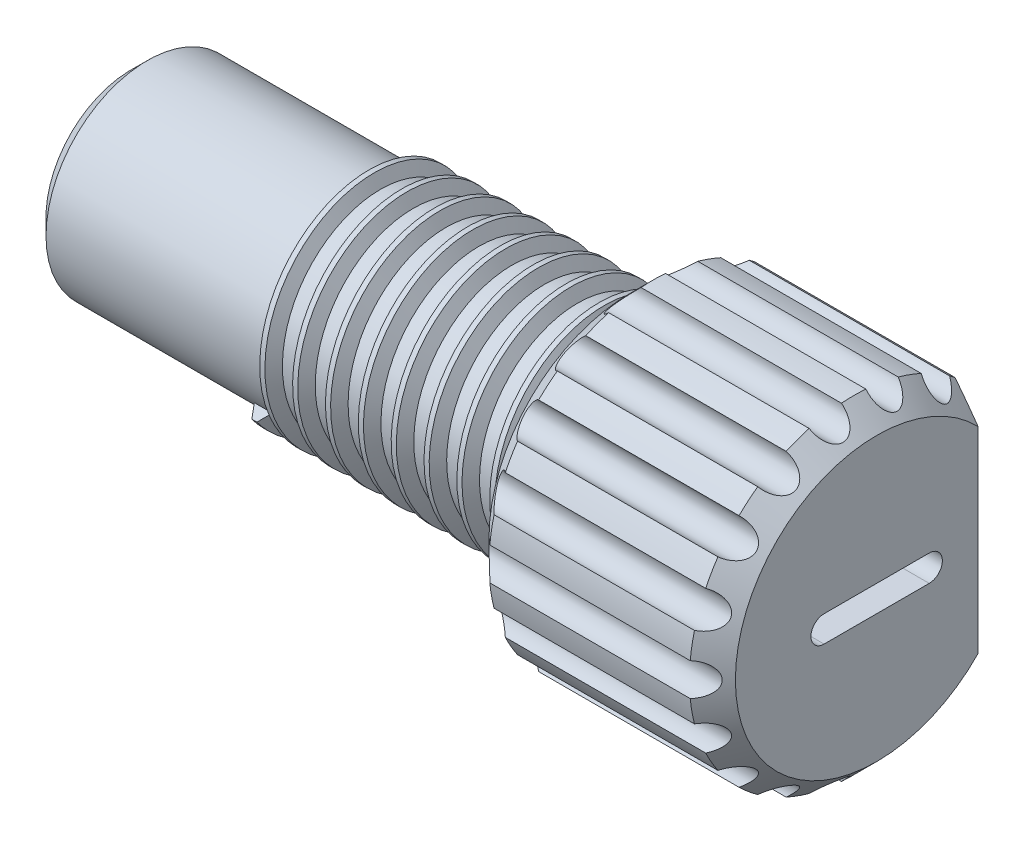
from build123d import *

# Parameters (mm, degrees)
SKETCH1_R             = 3.91795
BOSS_EXTRUDE1_DEPTH   = 19.304
SKETCH2_R             = 6.35
BOSS_EXTRUDE2_DEPTH   = 9.525
CUT_EXTRUDE2_DEPTH    = 3.81
THREAD1_PITCH         = 1.27
THREAD1_HEIGHT        = 10.668
THREAD1_RADIUS        = 3.91795
THREAD1_START_ANGLE   = -180
CUT_EXTRUDE3_DEPTH    = 31.195301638
CHAMFER1_SIZE         = 0.889
CUT_EXTRUDE1_REACH    = 32.195
SKETCH3_R             = 0.635
CHAMFER2_SIZE         = 0.635
BODY_MOVE_COPY1_ANGLE = 180


with BuildPart() as part:
    # Sketch1 → Boss-Extrude1 (new body)
    with BuildSketch(Plane(origin=(0, 0, 0), x_dir=(1, 0, 0), z_dir=(0, 1, 0))):
        with Locations(Location((0, 0, 0), (0, 0, 270))):
            Circle(SKETCH1_R)
    extrude(amount=BOSS_EXTRUDE1_DEPTH)

    # Sketch2 → Boss-Extrude2 (add)
    with BuildSketch(Plane(origin=(0, 19.304, 0), x_dir=(1, 0, 0), z_dir=(0, 1, 0))):
        with Locations(Location((0, 0, 0), (0, 0, 90))):
            Circle(SKETCH2_R)
    extrude(amount=BOSS_EXTRUDE2_DEPTH)

    # Sketch4 → Cut-Extrude2 (cut)
    with BuildSketch(Plane(origin=(0, 28.829, 0), x_dir=(1, 0, 0), z_dir=(0, 1, 0))):
        with BuildLine():
            Line((-0.508, -2.032), (-0.508, 2.032))
            ThreePointArc((-0.508, 2.032), (0, 2.54), (0.508, 2.032))
            Line((0.508, 2.032), (0.508, -2.032))
            ThreePointArc((0.508, -2.032), (0, -2.54), (-0.508, -2.032))
        make_face()
    extrude(amount=-CUT_EXTRUDE2_DEPTH, mode=Mode.SUBTRACT)

    # Thread1: sweep along a helix
    with BuildLine() as thread1_path:
        add(Helix(THREAD1_PITCH, THREAD1_HEIGHT, THREAD1_RADIUS, center=(0, 19.304, 0), direction=(0, -1, 0), mode=Mode.PRIVATE).rotate(Axis((0, 19.304, 0), (0, -1, 0)), THREAD1_START_ANGLE))
    # Thread Profile1 → Thread1 (sweep)
    with BuildSketch(Plane(origin=(0, 19.304, 3.91795), x_dir=(0, 0, -1), z_dir=(-1, 0, 0))):
        Polygon((0, 0), (0, 0.694531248), (-0.429629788, 0.446484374), (-0.429629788, 0.248046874), align=None)
    sweep(path=thread1_path.line, is_frenet=True)

    # Sketch8 → Cut-Extrude3 (cut, through all)
    with BuildSketch(Plane.XZ):
        with BuildLine():
            Line((6.35, 3.91795), (-6.35, 3.91795))
            ThreePointArc((-6.35, 3.91795), (0, 10.26795), (6.35, 3.91795))
        make_face()
    extrude(amount=-CUT_EXTRUDE3_DEPTH, mode=Mode.SUBTRACT)

    # Chamfer1
    chamfer1_edges = [part.edges().sort_by_distance(p)[0] for p in [
        (0, 19.304, -6.35),
        (0, 28.829, -6.35),
    ]]
    chamfer(chamfer1_edges, length=CHAMFER1_SIZE)

    # Cut-Extrude1: up to this cone (the profile starts inside it)
    cut_extrude1_end = Plane(origin=(0, 28.829, 0), z_dir=(0, 1, 0)).offset(-14.985999) * Cone(1e-06, 62.667, 62.666999, align=(Align.CENTER, Align.CENTER, Align.MIN), mode=Mode.PRIVATE)
    # Sketch3 → Cut-Extrude1 (cut, up to the surface)
    with BuildSketch(Plane(origin=(0, 28.829, 0), x_dir=(1, 0, 0), z_dir=(0, 1, 0)), mode=Mode.PRIVATE) as cut_extrude1_sk1:
        with Locations((0, 6.35)):
            Circle(SKETCH3_R)
    cut_extrude1_tool1 = extrude(cut_extrude1_sk1.sketch, amount=-CUT_EXTRUDE1_REACH, mode=Mode.PRIVATE) & cut_extrude1_end
    add(cut_extrude1_tool1.solids().sort_by_distance((0, 28.829, -6.35))[0], mode=Mode.SUBTRACT)
    # Sketch3 → Cut-Extrude1 (cut, up to the surface)
    with BuildSketch(Plane(origin=(0, 28.829, 0), x_dir=(1, 0, 0), z_dir=(0, 1, 0)), mode=Mode.PRIVATE) as cut_extrude1_sk2:
        with Locations((2.17182791, 5.967048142)):
            Circle(SKETCH3_R)
    cut_extrude1_tool2 = extrude(cut_extrude1_sk2.sketch, amount=-CUT_EXTRUDE1_REACH, mode=Mode.PRIVATE) & cut_extrude1_end
    add(cut_extrude1_tool2.solids().sort_by_distance((2.171828, 28.829, -5.967048))[0], mode=Mode.SUBTRACT)
    # Sketch3 → Cut-Extrude1 (cut, up to the surface)
    with BuildSketch(Plane(origin=(0, 28.829, 0), x_dir=(1, 0, 0), z_dir=(0, 1, 0)), mode=Mode.PRIVATE) as cut_extrude1_sk3:
        with Locations((4.081701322, 4.864382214)):
            Circle(SKETCH3_R)
    cut_extrude1_tool3 = extrude(cut_extrude1_sk3.sketch, amount=-CUT_EXTRUDE1_REACH, mode=Mode.PRIVATE) & cut_extrude1_end
    add(cut_extrude1_tool3.solids().sort_by_distance((4.081701, 28.829, -4.864382))[0], mode=Mode.SUBTRACT)
    # Sketch3 → Cut-Extrude1 (cut, up to the surface)
    with BuildSketch(Plane(origin=(0, 28.829, 0), x_dir=(1, 0, 0), z_dir=(0, 1, 0)), mode=Mode.PRIVATE) as cut_extrude1_sk4:
        with Locations((5.499261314, 3.175)):
            Circle(SKETCH3_R)
    cut_extrude1_tool4 = extrude(cut_extrude1_sk4.sketch, amount=-CUT_EXTRUDE1_REACH, mode=Mode.PRIVATE) & cut_extrude1_end
    add(cut_extrude1_tool4.solids().sort_by_distance((5.499261, 28.829, -3.175))[0], mode=Mode.SUBTRACT)
    # Sketch3 → Cut-Extrude1 (cut, up to the surface)
    with BuildSketch(Plane(origin=(0, 28.829, 0), x_dir=(1, 0, 0), z_dir=(0, 1, 0)), mode=Mode.PRIVATE) as cut_extrude1_sk5:
        with Locations((6.253529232, 1.102665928)):
            Circle(SKETCH3_R)
    cut_extrude1_tool5 = extrude(cut_extrude1_sk5.sketch, amount=-CUT_EXTRUDE1_REACH, mode=Mode.PRIVATE) & cut_extrude1_end
    add(cut_extrude1_tool5.solids().sort_by_distance((6.253529, 28.829, -1.102666))[0], mode=Mode.SUBTRACT)
    # Sketch3 → Cut-Extrude1 (cut, up to the surface)
    with BuildSketch(Plane(origin=(0, 28.829, 0), x_dir=(1, 0, 0), z_dir=(0, 1, 0)), mode=Mode.PRIVATE) as cut_extrude1_sk6:
        with Locations((6.253529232, -1.102665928)):
            Circle(SKETCH3_R)
    cut_extrude1_tool6 = extrude(cut_extrude1_sk6.sketch, amount=-CUT_EXTRUDE1_REACH, mode=Mode.PRIVATE) & cut_extrude1_end
    add(cut_extrude1_tool6.solids().sort_by_distance((6.253529, 28.829, 1.102666))[0], mode=Mode.SUBTRACT)
    # Sketch3 → Cut-Extrude1 (cut, up to the surface)
    with BuildSketch(Plane(origin=(0, 28.829, 0), x_dir=(1, 0, 0), z_dir=(0, 1, 0)), mode=Mode.PRIVATE) as cut_extrude1_sk7:
        with Locations((5.499261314, -3.175)):
            Circle(SKETCH3_R)
    cut_extrude1_tool7 = extrude(cut_extrude1_sk7.sketch, amount=-CUT_EXTRUDE1_REACH, mode=Mode.PRIVATE) & cut_extrude1_end
    add(cut_extrude1_tool7.solids().sort_by_distance((5.499261, 28.829, 3.175))[0], mode=Mode.SUBTRACT)
    # Sketch3 → Cut-Extrude1 (cut, up to the surface)
    with BuildSketch(Plane(origin=(0, 28.829, 0), x_dir=(1, 0, 0), z_dir=(0, 1, 0)), mode=Mode.PRIVATE) as cut_extrude1_sk8:
        with Locations((4.081701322, -4.864382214)):
            Circle(SKETCH3_R)
    cut_extrude1_tool8 = extrude(cut_extrude1_sk8.sketch, amount=-CUT_EXTRUDE1_REACH, mode=Mode.PRIVATE) & cut_extrude1_end
    add(cut_extrude1_tool8.solids().sort_by_distance((4.081701, 28.829, 4.864382))[0], mode=Mode.SUBTRACT)
    # Sketch3 → Cut-Extrude1 (cut, up to the surface)
    with BuildSketch(Plane(origin=(0, 28.829, 0), x_dir=(1, 0, 0), z_dir=(0, 1, 0)), mode=Mode.PRIVATE) as cut_extrude1_sk9:
        with Locations((2.17182791, -5.967048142)):
            Circle(SKETCH3_R)
    cut_extrude1_tool9 = extrude(cut_extrude1_sk9.sketch, amount=-CUT_EXTRUDE1_REACH, mode=Mode.PRIVATE) & cut_extrude1_end
    add(cut_extrude1_tool9.solids().sort_by_distance((2.171828, 28.829, 5.967048))[0], mode=Mode.SUBTRACT)
    # Sketch3 → Cut-Extrude1 (cut, up to the surface)
    with BuildSketch(Plane(origin=(0, 28.829, 0), x_dir=(1, 0, 0), z_dir=(0, 1, 0)), mode=Mode.PRIVATE) as cut_extrude1_sk10:
        with Locations((0, -6.35)):
            Circle(SKETCH3_R)
    cut_extrude1_tool10 = extrude(cut_extrude1_sk10.sketch, amount=-CUT_EXTRUDE1_REACH, mode=Mode.PRIVATE) & cut_extrude1_end
    add(cut_extrude1_tool10.solids().sort_by_distance((0, 28.829, 6.35))[0], mode=Mode.SUBTRACT)
    # Sketch3 → Cut-Extrude1 (cut, up to the surface)
    with BuildSketch(Plane(origin=(0, 28.829, 0), x_dir=(1, 0, 0), z_dir=(0, 1, 0)), mode=Mode.PRIVATE) as cut_extrude1_sk11:
        with Locations((-2.17182791, -5.967048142)):
            Circle(SKETCH3_R)
    cut_extrude1_tool11 = extrude(cut_extrude1_sk11.sketch, amount=-CUT_EXTRUDE1_REACH, mode=Mode.PRIVATE) & cut_extrude1_end
    add(cut_extrude1_tool11.solids().sort_by_distance((-2.171828, 28.829, 5.967048))[0], mode=Mode.SUBTRACT)
    # Sketch3 → Cut-Extrude1 (cut, up to the surface)
    with BuildSketch(Plane(origin=(0, 28.829, 0), x_dir=(1, 0, 0), z_dir=(0, 1, 0)), mode=Mode.PRIVATE) as cut_extrude1_sk12:
        with Locations((-4.081701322, -4.864382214)):
            Circle(SKETCH3_R)
    cut_extrude1_tool12 = extrude(cut_extrude1_sk12.sketch, amount=-CUT_EXTRUDE1_REACH, mode=Mode.PRIVATE) & cut_extrude1_end
    add(cut_extrude1_tool12.solids().sort_by_distance((-4.081701, 28.829, 4.864382))[0], mode=Mode.SUBTRACT)
    # Sketch3 → Cut-Extrude1 (cut, up to the surface)
    with BuildSketch(Plane(origin=(0, 28.829, 0), x_dir=(1, 0, 0), z_dir=(0, 1, 0)), mode=Mode.PRIVATE) as cut_extrude1_sk13:
        with Locations((-5.499261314, -3.175)):
            Circle(SKETCH3_R)
    cut_extrude1_tool13 = extrude(cut_extrude1_sk13.sketch, amount=-CUT_EXTRUDE1_REACH, mode=Mode.PRIVATE) & cut_extrude1_end
    add(cut_extrude1_tool13.solids().sort_by_distance((-5.499261, 28.829, 3.175))[0], mode=Mode.SUBTRACT)
    # Sketch3 → Cut-Extrude1 (cut, up to the surface)
    with BuildSketch(Plane(origin=(0, 28.829, 0), x_dir=(1, 0, 0), z_dir=(0, 1, 0)), mode=Mode.PRIVATE) as cut_extrude1_sk14:
        with Locations((-6.253529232, -1.102665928)):
            Circle(SKETCH3_R)
    cut_extrude1_tool14 = extrude(cut_extrude1_sk14.sketch, amount=-CUT_EXTRUDE1_REACH, mode=Mode.PRIVATE) & cut_extrude1_end
    add(cut_extrude1_tool14.solids().sort_by_distance((-6.253529, 28.829, 1.102666))[0], mode=Mode.SUBTRACT)
    # Sketch3 → Cut-Extrude1 (cut, up to the surface)
    with BuildSketch(Plane(origin=(0, 28.829, 0), x_dir=(1, 0, 0), z_dir=(0, 1, 0)), mode=Mode.PRIVATE) as cut_extrude1_sk15:
        with Locations((-6.253529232, 1.102665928)):
            Circle(SKETCH3_R)
    cut_extrude1_tool15 = extrude(cut_extrude1_sk15.sketch, amount=-CUT_EXTRUDE1_REACH, mode=Mode.PRIVATE) & cut_extrude1_end
    add(cut_extrude1_tool15.solids().sort_by_distance((-6.253529, 28.829, -1.102666))[0], mode=Mode.SUBTRACT)
    # Sketch3 → Cut-Extrude1 (cut, up to the surface)
    with BuildSketch(Plane(origin=(0, 28.829, 0), x_dir=(1, 0, 0), z_dir=(0, 1, 0)), mode=Mode.PRIVATE) as cut_extrude1_sk16:
        with Locations((-5.499261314, 3.175)):
            Circle(SKETCH3_R)
    cut_extrude1_tool16 = extrude(cut_extrude1_sk16.sketch, amount=-CUT_EXTRUDE1_REACH, mode=Mode.PRIVATE) & cut_extrude1_end
    add(cut_extrude1_tool16.solids().sort_by_distance((-5.499261, 28.829, -3.175))[0], mode=Mode.SUBTRACT)
    # Sketch3 → Cut-Extrude1 (cut, up to the surface)
    with BuildSketch(Plane(origin=(0, 28.829, 0), x_dir=(1, 0, 0), z_dir=(0, 1, 0)), mode=Mode.PRIVATE) as cut_extrude1_sk17:
        with Locations((-4.081701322, 4.864382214)):
            Circle(SKETCH3_R)
    cut_extrude1_tool17 = extrude(cut_extrude1_sk17.sketch, amount=-CUT_EXTRUDE1_REACH, mode=Mode.PRIVATE) & cut_extrude1_end
    add(cut_extrude1_tool17.solids().sort_by_distance((-4.081701, 28.829, -4.864382))[0], mode=Mode.SUBTRACT)
    # Sketch3 → Cut-Extrude1 (cut, up to the surface)
    with BuildSketch(Plane(origin=(0, 28.829, 0), x_dir=(1, 0, 0), z_dir=(0, 1, 0)), mode=Mode.PRIVATE) as cut_extrude1_sk18:
        with Locations((-2.17182791, 5.967048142)):
            Circle(SKETCH3_R)
    cut_extrude1_tool18 = extrude(cut_extrude1_sk18.sketch, amount=-CUT_EXTRUDE1_REACH, mode=Mode.PRIVATE) & cut_extrude1_end
    add(cut_extrude1_tool18.solids().sort_by_distance((-2.171828, 28.829, -5.967048))[0], mode=Mode.SUBTRACT)

    # Chamfer2
    chamfer2_edges = [part.edges().sort_by_distance(p)[0] for p in [
        (0, 0, -3.91795),
    ]]
    chamfer(chamfer2_edges, length=CHAMFER2_SIZE)


with BuildPart() as part_1:
    # Body-Move_Copy1: moved
    add(part.part.moved(Location((0, 0, 0))).rotate(Axis((-7.20725, 7.20725, -1.021371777), (0.7071067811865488, 0.7071067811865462, 4.937700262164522e-15)), BODY_MOVE_COPY1_ANGLE))


solid = part_1.part
